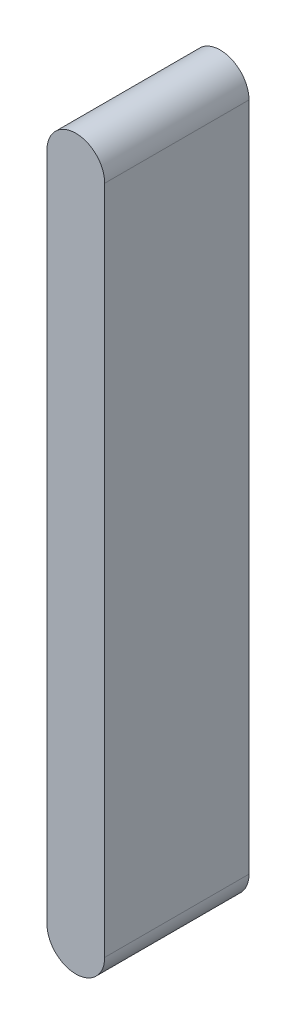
ISO-10303-21;
HEADER;
FILE_DESCRIPTION(('STEP AP214'),'2;1');
FILE_NAME('part.step','',(''),(''),'','','');
FILE_SCHEMA(('AUTOMOTIVE_DESIGN { 1 0 10303 214 1 1 1 1 }'));
ENDSEC;
DATA;
#1=APPLICATION_CONTEXT('core data for automotive mechanical design processes');
#2=APPLICATION_PROTOCOL_DEFINITION('international standard','automotive_design',2000,#1);
#3=PRODUCT_CONTEXT('',#1,'mechanical');
#4=PRODUCT('Part','Part','',(#3));
#5=PRODUCT_RELATED_PRODUCT_CATEGORY('part','',(#4));
#6=PRODUCT_DEFINITION_FORMATION('','',#4);
#7=PRODUCT_DEFINITION_CONTEXT('part definition',#1,'design');
#8=PRODUCT_DEFINITION('design','',#6,#7);
#9=PRODUCT_DEFINITION_SHAPE('','',#8);
#10=(LENGTH_UNIT() NAMED_UNIT(*) SI_UNIT(.MILLI.,.METRE.));
#11=(NAMED_UNIT(*) PLANE_ANGLE_UNIT() SI_UNIT($,.RADIAN.));
#12=(NAMED_UNIT(*) SI_UNIT($,.STERADIAN.) SOLID_ANGLE_UNIT());
#13=UNCERTAINTY_MEASURE_WITH_UNIT(LENGTH_MEASURE(1.E-05),#10,'distance_accuracy_value','');
#14=(GEOMETRIC_REPRESENTATION_CONTEXT(3) GLOBAL_UNCERTAINTY_ASSIGNED_CONTEXT((#13)) GLOBAL_UNIT_ASSIGNED_CONTEXT((#10,
#11,#12)) REPRESENTATION_CONTEXT('',''));
#15=CARTESIAN_POINT('',(0.,0.,0.));
#16=DIRECTION('',(0.,0.,1.));
#17=DIRECTION('',(1.,0.,0.));
#18=AXIS2_PLACEMENT_3D('',#15,#16,#17);
#19=CARTESIAN_POINT('',(-1.5,5.787332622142,-0.375));
#20=DIRECTION('',(0.,0.,1.));
#21=DIRECTION('',(0.,-1.,0.));
#22=AXIS2_PLACEMENT_3D('',#19,#20,#21);
#23=CYLINDRICAL_SURFACE('',#22,0.15);
#24=CARTESIAN_POINT('',(-1.5,5.787332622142,0.375));
#25=DIRECTION('',(0.,0.,-1.));
#26=DIRECTION('',(-1.,0.,0.));
#27=AXIS2_PLACEMENT_3D('',#24,#25,#26);
#28=CIRCLE('',#27,0.15);
#29=CARTESIAN_POINT('',(-1.65,5.787332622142,0.375));
#30=VERTEX_POINT('',#29);
#31=CARTESIAN_POINT('',(-1.35,5.787332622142,0.375));
#32=VERTEX_POINT('',#31);
#33=EDGE_CURVE('E11',#30,#32,#28,.T.);
#34=ORIENTED_EDGE('',*,*,#33,.T.);
#35=DIRECTION('',(0.,0.,1.));
#36=VECTOR('',#35,1.);
#37=CARTESIAN_POINT('',(-1.35,5.787332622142,-0.375));
#38=LINE('',#37,#36);
#39=CARTESIAN_POINT('',(-1.35,5.787332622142,-0.375));
#40=VERTEX_POINT('',#39);
#41=EDGE_CURVE('E25',#40,#32,#38,.T.);
#42=ORIENTED_EDGE('',*,*,#41,.F.);
#43=CARTESIAN_POINT('',(-1.5,5.787332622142,-0.375));
#44=DIRECTION('',(0.,0.,-1.));
#45=DIRECTION('',(-1.,0.,0.));
#46=AXIS2_PLACEMENT_3D('',#43,#44,#45);
#47=CIRCLE('',#46,0.15);
#48=CARTESIAN_POINT('',(-1.65,5.787332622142,-0.375));
#49=VERTEX_POINT('',#48);
#50=EDGE_CURVE('E95',#49,#40,#47,.T.);
#51=ORIENTED_EDGE('',*,*,#50,.F.);
#52=DIRECTION('',(0.,0.,1.));
#53=VECTOR('',#52,1.);
#54=CARTESIAN_POINT('',(-1.65,5.787332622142,-0.375));
#55=LINE('',#54,#53);
#56=EDGE_CURVE('E91',#49,#30,#55,.T.);
#57=ORIENTED_EDGE('',*,*,#56,.T.);
#58=EDGE_LOOP('',(#34,#42,#51,#57));
#59=FACE_BOUND('',#58,.T.);
#60=ADVANCED_FACE('F17',(#59),#23,.T.);
#61=CARTESIAN_POINT('',(-1.65,5.787332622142,-0.375));
#62=DIRECTION('',(1.,0.,0.));
#63=DIRECTION('',(0.,1.,0.));
#64=AXIS2_PLACEMENT_3D('',#61,#62,#63);
#65=PLANE('',#64);
#66=DIRECTION('',(0.,1.,0.));
#67=VECTOR('',#66,1.);
#68=CARTESIAN_POINT('',(-1.65,5.787332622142,0.375));
#69=LINE('',#68,#67);
#70=CARTESIAN_POINT('',(-1.65,2.302902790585,0.375));
#71=VERTEX_POINT('',#70);
#72=EDGE_CURVE('E73',#71,#30,#69,.T.);
#73=ORIENTED_EDGE('',*,*,#72,.T.);
#74=ORIENTED_EDGE('',*,*,#56,.F.);
#75=DIRECTION('',(0.,1.,0.));
#76=VECTOR('',#75,1.);
#77=CARTESIAN_POINT('',(-1.65,5.787332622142,-0.375));
#78=LINE('',#77,#76);
#79=CARTESIAN_POINT('',(-1.65,2.302902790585,-0.375));
#80=VERTEX_POINT('',#79);
#81=EDGE_CURVE('E76',#80,#49,#78,.T.);
#82=ORIENTED_EDGE('',*,*,#81,.F.);
#83=DIRECTION('',(0.,0.,1.));
#84=VECTOR('',#83,1.);
#85=CARTESIAN_POINT('',(-1.65,2.302902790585,-0.375));
#86=LINE('',#85,#84);
#87=EDGE_CURVE('E74',#80,#71,#86,.T.);
#88=ORIENTED_EDGE('',*,*,#87,.T.);
#89=EDGE_LOOP('',(#73,#74,#82,#88));
#90=FACE_BOUND('',#89,.T.);
#91=ADVANCED_FACE('F108',(#90),#65,.F.);
#92=CARTESIAN_POINT('',(-1.5,2.302902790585,-0.375));
#93=DIRECTION('',(0.,0.,1.));
#94=DIRECTION('',(0.,1.,0.));
#95=AXIS2_PLACEMENT_3D('',#92,#93,#94);
#96=CYLINDRICAL_SURFACE('',#95,0.15);
#97=CARTESIAN_POINT('',(-1.5,2.302902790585,0.375));
#98=DIRECTION('',(0.,0.,-1.));
#99=DIRECTION('',(-1.,0.,0.));
#100=AXIS2_PLACEMENT_3D('',#97,#98,#99);
#101=CIRCLE('',#100,0.15);
#102=CARTESIAN_POINT('',(-1.35,2.302902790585,0.375));
#103=VERTEX_POINT('',#102);
#104=EDGE_CURVE('E59',#103,#71,#101,.T.);
#105=ORIENTED_EDGE('',*,*,#104,.T.);
#106=ORIENTED_EDGE('',*,*,#87,.F.);
#107=CARTESIAN_POINT('',(-1.5,2.302902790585,-0.375));
#108=DIRECTION('',(0.,0.,-1.));
#109=DIRECTION('',(-1.,0.,0.));
#110=AXIS2_PLACEMENT_3D('',#107,#108,#109);
#111=CIRCLE('',#110,0.15);
#112=CARTESIAN_POINT('',(-1.35,2.302902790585,-0.375));
#113=VERTEX_POINT('',#112);
#114=EDGE_CURVE('E62',#113,#80,#111,.T.);
#115=ORIENTED_EDGE('',*,*,#114,.F.);
#116=DIRECTION('',(0.,0.,1.));
#117=VECTOR('',#116,1.);
#118=CARTESIAN_POINT('',(-1.35,2.302902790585,-0.375));
#119=LINE('',#118,#117);
#120=EDGE_CURVE('E54',#113,#103,#119,.T.);
#121=ORIENTED_EDGE('',*,*,#120,.T.);
#122=EDGE_LOOP('',(#105,#106,#115,#121));
#123=FACE_BOUND('',#122,.T.);
#124=ADVANCED_FACE('F56',(#123),#96,.T.);
#125=CARTESIAN_POINT('',(-1.35,5.787332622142,-0.375));
#126=DIRECTION('',(-1.,0.,0.));
#127=DIRECTION('',(0.,-1.,0.));
#128=AXIS2_PLACEMENT_3D('',#125,#126,#127);
#129=PLANE('',#128);
#130=DIRECTION('',(0.,-1.,0.));
#131=VECTOR('',#130,1.);
#132=CARTESIAN_POINT('',(-1.35,5.787332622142,0.375));
#133=LINE('',#132,#131);
#134=EDGE_CURVE('E65',#32,#103,#133,.T.);
#135=ORIENTED_EDGE('',*,*,#134,.T.);
#136=ORIENTED_EDGE('',*,*,#120,.F.);
#137=DIRECTION('',(0.,-1.,0.));
#138=VECTOR('',#137,1.);
#139=CARTESIAN_POINT('',(-1.35,5.787332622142,-0.375));
#140=LINE('',#139,#138);
#141=EDGE_CURVE('E69',#40,#113,#140,.T.);
#142=ORIENTED_EDGE('',*,*,#141,.F.);
#143=ORIENTED_EDGE('',*,*,#41,.T.);
#144=EDGE_LOOP('',(#135,#136,#142,#143));
#145=FACE_BOUND('',#144,.T.);
#146=ADVANCED_FACE('F67',(#145),#129,.F.);
#147=CARTESIAN_POINT('',(-1.5,5.787332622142,-0.375));
#148=DIRECTION('',(0.,0.,-1.));
#149=DIRECTION('',(-1.,0.,0.));
#150=AXIS2_PLACEMENT_3D('',#147,#148,#149);
#151=PLANE('',#150);
#152=ORIENTED_EDGE('',*,*,#50,.T.);
#153=ORIENTED_EDGE('',*,*,#141,.T.);
#154=ORIENTED_EDGE('',*,*,#114,.T.);
#155=ORIENTED_EDGE('',*,*,#81,.T.);
#156=EDGE_LOOP('',(#152,#153,#154,#155));
#157=FACE_BOUND('',#156,.T.);
#158=ADVANCED_FACE('F105',(#157),#151,.T.);
#159=CARTESIAN_POINT('',(-1.5,5.787332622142,0.375));
#160=DIRECTION('',(0.,0.,-1.));
#161=DIRECTION('',(-1.,0.,0.));
#162=AXIS2_PLACEMENT_3D('',#159,#160,#161);
#163=PLANE('',#162);
#164=ORIENTED_EDGE('',*,*,#33,.F.);
#165=ORIENTED_EDGE('',*,*,#72,.F.);
#166=ORIENTED_EDGE('',*,*,#104,.F.);
#167=ORIENTED_EDGE('',*,*,#134,.F.);
#168=EDGE_LOOP('',(#164,#165,#166,#167));
#169=FACE_BOUND('',#168,.T.);
#170=ADVANCED_FACE('F71',(#169),#163,.F.);
#171=CLOSED_SHELL('',(#60,#91,#124,#146,#158,#170));
#172=MANIFOLD_SOLID_BREP('B1',#171);
#173=ADVANCED_BREP_SHAPE_REPRESENTATION('',(#18,#172),#14);
#174=SHAPE_DEFINITION_REPRESENTATION(#9,#173);
ENDSEC;
END-ISO-10303-21;
